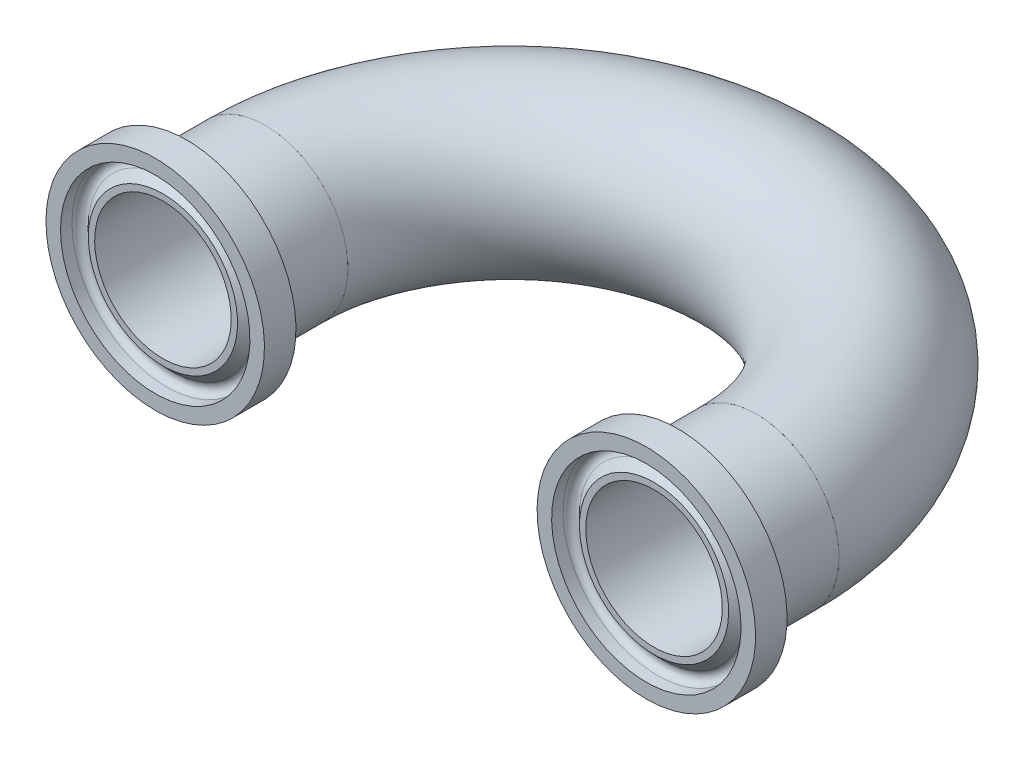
ISO-10303-21;
HEADER;
FILE_DESCRIPTION(('STEP AP214'),'2;1');
FILE_NAME('part.step','',(''),(''),'','','');
FILE_SCHEMA(('AUTOMOTIVE_DESIGN { 1 0 10303 214 1 1 1 1 }'));
ENDSEC;
DATA;
#1=APPLICATION_CONTEXT('core data for automotive mechanical design processes');
#2=APPLICATION_PROTOCOL_DEFINITION('international standard','automotive_design',2000,#1);
#3=PRODUCT_CONTEXT('',#1,'mechanical');
#4=PRODUCT('Part','Part','',(#3));
#5=PRODUCT_RELATED_PRODUCT_CATEGORY('part','',(#4));
#6=PRODUCT_DEFINITION_FORMATION('','',#4);
#7=PRODUCT_DEFINITION_CONTEXT('part definition',#1,'design');
#8=PRODUCT_DEFINITION('design','',#6,#7);
#9=PRODUCT_DEFINITION_SHAPE('','',#8);
#10=(LENGTH_UNIT() NAMED_UNIT(*) SI_UNIT(.MILLI.,.METRE.));
#11=(NAMED_UNIT(*) PLANE_ANGLE_UNIT() SI_UNIT($,.RADIAN.));
#12=(NAMED_UNIT(*) SI_UNIT($,.STERADIAN.) SOLID_ANGLE_UNIT());
#13=UNCERTAINTY_MEASURE_WITH_UNIT(LENGTH_MEASURE(1.E-05),#10,'distance_accuracy_value','');
#14=(GEOMETRIC_REPRESENTATION_CONTEXT(3) GLOBAL_UNCERTAINTY_ASSIGNED_CONTEXT((#13)) GLOBAL_UNIT_ASSIGNED_CONTEXT((#10,
#11,#12)) REPRESENTATION_CONTEXT('',''));
#15=CARTESIAN_POINT('',(0.,0.,0.));
#16=DIRECTION('',(0.,0.,1.));
#17=DIRECTION('',(1.,0.,0.));
#18=AXIS2_PLACEMENT_3D('',#15,#16,#17);
#19=CARTESIAN_POINT('',(-6.19954478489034,34.9272940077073,49.3880198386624));
#20=DIRECTION('',(0.,0.,-1.));
#21=DIRECTION('',(-1.,0.,0.));
#22=AXIS2_PLACEMENT_3D('',#19,#20,#21);
#23=CIRCLE('',#22,9.525);
#24=CARTESIAN_POINT('',(22.3743104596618,34.9272940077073,49.643796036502));
#25=DIRECTION('',(0.,-1.,0.));
#26=AXIS1_PLACEMENT('',#24,#25);
#27=SURFACE_OF_REVOLUTION('',#23,#26);
#28=CARTESIAN_POINT('',(-15.7245447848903,34.9272940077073,49.388019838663));
#29=VERTEX_POINT('',#28);
#30=EDGE_CURVE('P0_E10',#29,#29,#23,.T.);
#31=ORIENTED_EDGE('',*,*,#30,.T.);
#32=EDGE_LOOP('',(#31));
#33=FACE_BOUND('',#32,.T.);
#34=CARTESIAN_POINT('',(50.9481657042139,34.9272940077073,49.8995722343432));
#35=DIRECTION('',(0.,0.,1.));
#36=DIRECTION('',(1.,0.,0.));
#37=AXIS2_PLACEMENT_3D('',#34,#35,#36);
#38=CIRCLE('',#37,9.525);
#39=CARTESIAN_POINT('',(60.4731657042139,34.9272940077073,49.8995722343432));
#40=VERTEX_POINT('',#39);
#41=EDGE_CURVE('P0_E22',#40,#40,#38,.T.);
#42=ORIENTED_EDGE('',*,*,#41,.F.);
#43=EDGE_LOOP('',(#42));
#44=FACE_BOUND('',#43,.T.);
#45=ADVANCED_FACE('P0_F15',(#33,#44),#27,.F.);
#46=CARTESIAN_POINT('',(-6.19954478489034,34.9272940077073,49.3880198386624));
#47=DIRECTION('',(0.,0.,-1.));
#48=DIRECTION('',(-1.,0.,0.));
#49=AXIS2_PLACEMENT_3D('',#46,#47,#48);
#50=PLANE('',#49);
#51=CARTESIAN_POINT('',(1.67431825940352,34.9272940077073,49.3880198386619));
#52=CARTESIAN_POINT('',(1.67431984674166,34.7060670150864,49.3880198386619));
#53=CARTESIAN_POINT('',(1.66499138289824,34.4848660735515,49.3880198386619));
#54=CARTESIAN_POINT('',(1.62774261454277,34.0439625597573,49.3880198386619));
#55=CARTESIAN_POINT('',(1.5998174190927,33.8242603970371,49.3880198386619));
#56=CARTESIAN_POINT('',(1.52553355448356,33.3877967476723,49.3880198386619));
#57=CARTESIAN_POINT('',(1.47915847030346,33.1710380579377,49.388019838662));
#58=CARTESIAN_POINT('',(1.36828516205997,32.7421207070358,49.388019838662));
#59=CARTESIAN_POINT('',(1.30378031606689,32.529963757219,49.388019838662));
#60=CARTESIAN_POINT('',(1.15716259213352,32.1119834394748,49.388019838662));
#61=CARTESIAN_POINT('',(1.0750614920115,31.9061559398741,49.388019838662));
#62=CARTESIAN_POINT('',(0.893808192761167,31.5021468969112,49.388019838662));
#63=CARTESIAN_POINT('',(0.794655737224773,31.3039654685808,49.388019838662));
#64=CARTESIAN_POINT('',(0.580034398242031,30.916713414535,49.388019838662));
#65=CARTESIAN_POINT('',(0.464569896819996,30.7276403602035,49.388019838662));
#66=CARTESIAN_POINT('',(0.218122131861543,30.3598878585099,49.388019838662));
#67=CARTESIAN_POINT('',(0.0871385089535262,30.1812086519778,49.388019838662));
#68=CARTESIAN_POINT('',(-0.189400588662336,29.8355360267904,49.3880198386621));
#69=CARTESIAN_POINT('',(-0.334954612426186,29.6685414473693,49.3880198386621));
#70=CARTESIAN_POINT('',(-0.63966385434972,29.347349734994,49.3880198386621));
#71=CARTESIAN_POINT('',(-0.798823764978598,29.1931570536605,49.3880198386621));
#72=CARTESIAN_POINT('',(-1.12954601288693,28.8987512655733,49.3880198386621));
#73=CARTESIAN_POINT('',(-1.30110659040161,28.758536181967,49.3880198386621));
#74=CARTESIAN_POINT('',(-1.6554331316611,28.4930556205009,49.3880198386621));
#75=CARTESIAN_POINT('',(-1.83819926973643,28.3677903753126,49.3880198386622));
#76=CARTESIAN_POINT('',(-2.21362354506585,28.1331098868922,49.3880198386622));
#77=CARTESIAN_POINT('',(-2.4062810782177,28.0236936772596,49.3880198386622));
#78=CARTESIAN_POINT('',(-2.80013311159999,27.8214777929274,49.3880198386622));
#79=CARTESIAN_POINT('',(-3.00132780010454,27.7286784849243,49.3880198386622));
#80=CARTESIAN_POINT('',(-3.41078153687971,27.5603748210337,49.3880198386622));
#81=CARTESIAN_POINT('',(-3.61903926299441,27.4848672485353,49.3880198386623));
#82=CARTESIAN_POINT('',(-4.0412476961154,27.3516384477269,49.3880198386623));
#83=CARTESIAN_POINT('',(-4.25520034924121,27.2939233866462,49.3880198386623));
#84=CARTESIAN_POINT('',(-4.68716813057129,27.1967343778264,49.3880198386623));
#85=CARTESIAN_POINT('',(-4.90518250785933,27.1572570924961,49.3880198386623));
#86=CARTESIAN_POINT('',(-5.34376535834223,27.0968081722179,49.3880198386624));
#87=CARTESIAN_POINT('',(-5.56433387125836,27.0758368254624,49.3880198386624));
#88=CARTESIAN_POINT('',(-6.00644894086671,27.052550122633,49.3880198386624));
#89=CARTESIAN_POINT('',(-6.22799547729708,27.0502343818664,49.3880198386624));
#90=CARTESIAN_POINT('',(-6.6705010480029,27.0642744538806,49.3880198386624));
#91=CARTESIAN_POINT('',(-6.89146006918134,27.0806306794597,49.3880198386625));
#92=CARTESIAN_POINT('',(-7.33117608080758,27.1318945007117,49.3880198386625));
#93=CARTESIAN_POINT('',(-7.54993345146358,27.1667988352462,49.3880198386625));
#94=CARTESIAN_POINT('',(-7.98380616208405,27.2549240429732,49.3880198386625));
#95=CARTESIAN_POINT('',(-8.19892021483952,27.3081512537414,49.3880198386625));
#96=CARTESIAN_POINT('',(-8.62386043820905,27.4325298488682,49.3880198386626));
#97=CARTESIAN_POINT('',(-8.83368755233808,27.5036780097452,49.3880198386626));
#98=CARTESIAN_POINT('',(-9.24660560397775,27.663398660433,49.3880198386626));
#99=CARTESIAN_POINT('',(-9.44969643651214,27.7519714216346,49.3880198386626));
#100=CARTESIAN_POINT('',(-9.84769272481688,27.9459099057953,49.3880198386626));
#101=CARTESIAN_POINT('',(-10.042598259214,28.0512754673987,49.3880198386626));
#102=CARTESIAN_POINT('',(-10.4228446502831,28.2780536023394,49.3880198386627));
#103=CARTESIAN_POINT('',(-10.6081852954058,28.3994665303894,49.3880198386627));
#104=CARTESIAN_POINT('',(-10.9679463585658,28.65745053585,49.3880198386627));
#105=CARTESIAN_POINT('',(-11.1423687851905,28.7940188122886,49.3880198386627));
#106=CARTESIAN_POINT('',(-11.4791494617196,29.0814109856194,49.3880198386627));
#107=CARTESIAN_POINT('',(-11.6415035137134,29.232239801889,49.3880198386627));
#108=CARTESIAN_POINT('',(-11.9528989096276,29.547012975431,49.3880198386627));
#109=CARTESIAN_POINT('',(-12.1019425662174,29.7109550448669,49.3880198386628));
#110=CARTESIAN_POINT('',(-12.3856915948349,30.0508147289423,49.3880198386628));
#111=CARTESIAN_POINT('',(-12.5203967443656,30.226732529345,49.3880198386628));
#112=CARTESIAN_POINT('',(-12.7745060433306,30.5892873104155,49.3880198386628));
#113=CARTESIAN_POINT('',(-12.893910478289,30.7759240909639,49.3880198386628));
#114=CARTESIAN_POINT('',(-13.1165749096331,31.1585972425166,49.3880198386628));
#115=CARTESIAN_POINT('',(-13.2198345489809,31.3546338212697,49.3880198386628));
#116=CARTESIAN_POINT('',(-13.4094546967,31.7546722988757,49.3880198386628));
#117=CARTESIAN_POINT('',(-13.4958182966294,31.95867273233,49.3880198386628));
#118=CARTESIAN_POINT('',(-13.6510834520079,32.3732957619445,49.3880198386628));
#119=CARTESIAN_POINT('',(-13.7199788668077,32.5839206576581,49.3880198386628));
#120=CARTESIAN_POINT('',(-13.8397539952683,33.0101405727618,49.3880198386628));
#121=CARTESIAN_POINT('',(-13.8906409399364,33.2257335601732,49.3880198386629));
#122=CARTESIAN_POINT('',(-13.9740950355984,33.6605379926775,49.3880198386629));
#123=CARTESIAN_POINT('',(-14.0066538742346,33.8797510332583,49.3880198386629));
#124=CARTESIAN_POINT('',(-14.0531846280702,34.3201412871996,49.3880198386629));
#125=CARTESIAN_POINT('',(-14.0671565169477,34.5413185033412,49.3880198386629));
#126=CARTESIAN_POINT('',(-14.0764118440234,34.9839632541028,49.3880198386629));
#127=CARTESIAN_POINT('',(-14.0717037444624,35.2054306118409,49.3880198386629));
#128=CARTESIAN_POINT('',(-14.0436459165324,35.6472708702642,49.3880198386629));
#129=CARTESIAN_POINT('',(-14.0202886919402,35.8676432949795,49.3880198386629));
#130=CARTESIAN_POINT('',(-13.9551008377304,36.3055595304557,49.3880198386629));
#131=CARTESIAN_POINT('',(-13.9132766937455,36.5231043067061,49.3880198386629));
#132=CARTESIAN_POINT('',(-13.8114442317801,36.9539384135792,49.3880198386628));
#133=CARTESIAN_POINT('',(-13.7514325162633,37.1672269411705,49.3880198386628));
#134=CARTESIAN_POINT('',(-13.613655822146,37.587985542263,49.3880198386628));
#135=CARTESIAN_POINT('',(-13.5358912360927,37.7954557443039,49.3880198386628));
#136=CARTESIAN_POINT('',(-13.3631592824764,38.203111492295,49.3880198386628));
#137=CARTESIAN_POINT('',(-13.2681915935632,38.403296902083,49.3880198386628));
#138=CARTESIAN_POINT('',(-13.0617311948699,38.7949526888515,49.3880198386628));
#139=CARTESIAN_POINT('',(-12.9502387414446,38.9864232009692,49.3880198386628));
#140=CARTESIAN_POINT('',(-12.7114987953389,39.359324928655,49.3880198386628));
#141=CARTESIAN_POINT('',(-12.5842484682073,39.5407543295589,49.3880198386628));
#142=CARTESIAN_POINT('',(-12.3149603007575,39.8921853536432,49.3880198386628));
#143=CARTESIAN_POINT('',(-12.1729275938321,40.0621909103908,49.3880198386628));
#144=CARTESIAN_POINT('',(-11.8750201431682,40.3896650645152,49.3880198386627));
#145=CARTESIAN_POINT('',(-11.7191428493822,40.5471313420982,49.3880198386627));
#146=CARTESIAN_POINT('',(-11.3946804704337,40.8483691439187,49.3880198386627));
#147=CARTESIAN_POINT('',(-11.2260956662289,40.9921409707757,49.3880198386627));
#148=CARTESIAN_POINT('',(-10.8774107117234,41.2649740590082,49.3880198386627));
#149=CARTESIAN_POINT('',(-10.6973103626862,41.3940350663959,49.3880198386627));
#150=CARTESIAN_POINT('',(-10.3268802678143,41.6365241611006,49.3880198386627));
#151=CARTESIAN_POINT('',(-10.1365506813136,41.7499524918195,49.3880198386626));
#152=CARTESIAN_POINT('',(-9.74697754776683,41.960391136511,49.3880198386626));
#153=CARTESIAN_POINT('',(-9.54773240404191,42.057398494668,49.3880198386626));
#154=CARTESIAN_POINT('',(-9.14184739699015,42.2342497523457,49.3880198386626));
#155=CARTESIAN_POINT('',(-8.93521011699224,42.3140995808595,49.3880198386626));
#156=CARTESIAN_POINT('',(-8.51590652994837,42.4561235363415,49.3880198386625));
#157=CARTESIAN_POINT('',(-8.30323914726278,42.5182944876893,49.3880198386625));
#158=CARTESIAN_POINT('',(-7.87342764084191,42.6244983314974,49.3880198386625));
#159=CARTESIAN_POINT('',(-7.65628361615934,42.6685316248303,49.3880198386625));
#160=CARTESIAN_POINT('',(-7.21905346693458,42.7381497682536,49.3880198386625));
#161=CARTESIAN_POINT('',(-6.99896728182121,42.7637342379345,49.3880198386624));
#162=CARTESIAN_POINT('',(-6.55742540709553,42.7962710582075,49.3880198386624));
#163=CARTESIAN_POINT('',(-6.33596973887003,42.8032236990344,49.3880198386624));
#164=CARTESIAN_POINT('',(-5.89322191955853,42.7984477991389,49.3880198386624));
#165=CARTESIAN_POINT('',(-5.67192980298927,42.7867160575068,49.3880198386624));
#166=CARTESIAN_POINT('',(-5.23119735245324,42.7446560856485,49.3880198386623));
#167=CARTESIAN_POINT('',(-5.01175640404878,42.714334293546,49.3880198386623));
#168=CARTESIAN_POINT('',(-4.57616765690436,42.6353079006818,49.3880198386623));
#169=CARTESIAN_POINT('',(-4.36002047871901,42.5865998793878,49.3880198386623));
#170=CARTESIAN_POINT('',(-3.93260261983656,42.4711490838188,49.3880198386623));
#171=CARTESIAN_POINT('',(-3.72133183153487,42.4044067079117,49.3880198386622));
#172=CARTESIAN_POINT('',(-3.30515806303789,42.2533590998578,49.3880198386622));
#173=CARTESIAN_POINT('',(-3.1002552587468,42.1690533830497,49.3880198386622));
#174=CARTESIAN_POINT('',(-2.69828355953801,41.9834810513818,49.3880198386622));
#175=CARTESIAN_POINT('',(-2.50121454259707,41.882214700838,49.3880198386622));
#176=CARTESIAN_POINT('',(-2.11628084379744,41.6634246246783,49.3880198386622));
#177=CARTESIAN_POINT('',(-1.92841746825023,41.545898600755,49.3880198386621));
#178=CARTESIAN_POINT('',(-1.56332423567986,41.295479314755,49.3880198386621));
#179=CARTESIAN_POINT('',(-1.38609072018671,41.1625913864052,49.3880198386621));
#180=CARTESIAN_POINT('',(-1.04343338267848,40.8823495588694,49.3880198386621));
#181=CARTESIAN_POINT('',(-0.878010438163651,40.7349945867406,49.3880198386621));
#182=CARTESIAN_POINT('',(-0.560168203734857,40.4268779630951,49.3880198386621));
#183=CARTESIAN_POINT('',(-0.407748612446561,40.2661166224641,49.3880198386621));
#184=CARTESIAN_POINT('',(-0.116952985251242,39.9322821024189,49.388019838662));
#185=CARTESIAN_POINT('',(0.0214192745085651,39.7592056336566,49.388019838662));
#186=CARTESIAN_POINT('',(0.283087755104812,39.4020127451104,49.388019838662));
#187=CARTESIAN_POINT('',(0.406384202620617,39.2178964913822,49.388019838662));
#188=CARTESIAN_POINT('',(0.637105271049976,38.8398021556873,49.388019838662));
#189=CARTESIAN_POINT('',(0.74451906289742,38.6458174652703,49.388019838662));
#190=CARTESIAN_POINT('',(0.942573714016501,38.2495565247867,49.388019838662));
#191=CARTESIAN_POINT('',(1.03322069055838,38.0472833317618,49.388019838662));
#192=CARTESIAN_POINT('',(1.19707285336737,37.6359968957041,49.388019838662));
#193=CARTESIAN_POINT('',(1.27029350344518,37.4269898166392,49.388019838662));
#194=CARTESIAN_POINT('',(1.39885834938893,37.0036223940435,49.388019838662));
#195=CARTESIAN_POINT('',(1.45420724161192,36.7892634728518,49.3880198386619));
#196=CARTESIAN_POINT('',(1.55817639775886,36.3027475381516,49.3880198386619));
#197=CARTESIAN_POINT('',(1.60169264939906,36.0294848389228,49.3880198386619));
#198=CARTESIAN_POINT('',(1.65976258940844,35.4798992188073,49.3880198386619));
#199=CARTESIAN_POINT('',(1.67431627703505,35.2035762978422,49.3880198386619));
#200=CARTESIAN_POINT('',(1.67431825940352,34.9272940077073,49.3880198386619));
#201=B_SPLINE_CURVE_WITH_KNOTS('',3,(#51,#52,#53,#54,#55,#56,#57,#58,#59,#60,#61,#62,#63,#64,
#65,#66,#67,#68,#69,#70,#71,#72,#73,#74,#75,#76,#77,#78,#79,#80,#81,#82,#83,#84,#85,#86,#87,#88,
#89,#90,#91,#92,#93,#94,#95,#96,#97,#98,#99,#100,#101,#102,#103,#104,#105,#106,#107,#108,#109,
#110,#111,#112,#113,#114,#115,#116,#117,#118,#119,#120,#121,#122,#123,#124,#125,#126,#127,#128,
#129,#130,#131,#132,#133,#134,#135,#136,#137,#138,#139,#140,#141,#142,#143,#144,#145,#146,#147,
#148,#149,#150,#151,#152,#153,#154,#155,#156,#157,#158,#159,#160,#161,#162,#163,#164,#165,#166,
#167,#168,#169,#170,#171,#172,#173,#174,#175,#176,#177,#178,#179,#180,#181,#182,#183,#184,#185,
#186,#187,#188,#189,#190,#191,#192,#193,#194,#195,#196,#197,#198,#199,#200),.UNSPECIFIED.,.T.,
.F.,(4,2,2,2,2,2,2,2,2,2,2,2,2,2,2,2,2,2,2,2,2,2,2,2,2,2,2,2,2,2,2,2,2,2,2,2,2,2,2,2,2,2,2,2,2,
2,2,2,2,2,2,2,2,2,2,2,2,2,2,2,2,2,2,2,2,2,2,2,2,2,2,2,2,2,4),(0.,0.663439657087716,
1.32705386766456,1.99125982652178,2.65570870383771,3.31971422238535,3.98372972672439,
4.64756718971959,5.31142002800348,5.97520682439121,6.63922348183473,7.30314609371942,
7.96707903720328,8.6309714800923,9.29487857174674,9.95866206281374,10.6226753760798,
11.2865671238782,11.9504692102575,12.6143576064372,13.2782606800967,13.942047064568,
14.606063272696,15.2699601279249,15.9338673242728,16.5977681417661,17.2616836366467,
17.9254766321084,18.5894994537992,19.2534066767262,19.9173242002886,20.5812293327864,
21.2451491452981,21.9089473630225,22.5729786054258,23.2367429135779,23.9008080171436,
24.5648740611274,25.2286393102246,25.8926715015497,26.5564706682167,27.2203939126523,
27.8843024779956,28.5482234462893,29.2121341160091,29.8761643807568,30.5399648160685,
31.2038877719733,31.8677960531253,32.5317157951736,33.1956251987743,33.8596539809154,
34.523452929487,35.1873710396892,35.8512744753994,36.5151916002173,37.1790983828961,
37.8431189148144,38.5069096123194,39.1708238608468,39.8347234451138,40.4986413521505,
41.1625489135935,41.8265504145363,42.4903220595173,43.1541429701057,43.8179484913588,
44.4819319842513,45.145905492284,45.8103296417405,46.4745108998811,47.1381005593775,
47.8015156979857,48.6300611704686,49.4586066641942),.UNSPECIFIED.);
#202=CARTESIAN_POINT('',(1.67431825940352,34.9272940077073,49.3880198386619));
#203=VERTEX_POINT('',#202);
#204=EDGE_CURVE('P0_E26',#203,#203,#201,.T.);
#205=ORIENTED_EDGE('',*,*,#204,.T.);
#206=EDGE_LOOP('',(#205));
#207=FACE_BOUND('',#206,.T.);
#208=ORIENTED_EDGE('',*,*,#30,.F.);
#209=EDGE_LOOP('',(#208));
#210=FACE_BOUND('',#209,.T.);
#211=ADVANCED_FACE('P0_F53',(#207,#210),#50,.F.);
#212=CARTESIAN_POINT('',(50.9481657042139,34.9272940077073,49.8995722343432));
#213=DIRECTION('',(0.,0.,1.));
#214=DIRECTION('',(1.,0.,0.));
#215=AXIS2_PLACEMENT_3D('',#212,#213,#214);
#216=PLANE('',#215);
#217=CARTESIAN_POINT('',(43.07430265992,34.9272940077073,49.8995722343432));
#218=CARTESIAN_POINT('',(43.0743010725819,34.7060670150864,49.8995722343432));
#219=CARTESIAN_POINT('',(43.0836295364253,34.4848660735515,49.8995722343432));
#220=CARTESIAN_POINT('',(43.1208783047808,34.0439625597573,49.8995722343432));
#221=CARTESIAN_POINT('',(43.1488035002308,33.8242603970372,49.8995722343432));
#222=CARTESIAN_POINT('',(43.22308736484,33.3877967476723,49.8995722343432));
#223=CARTESIAN_POINT('',(43.2694624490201,33.1710380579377,49.8995722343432));
#224=CARTESIAN_POINT('',(43.3803357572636,32.7421207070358,49.8995722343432));
#225=CARTESIAN_POINT('',(43.4448406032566,32.529963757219,49.8995722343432));
#226=CARTESIAN_POINT('',(43.59145832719,32.1119834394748,49.8995722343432));
#227=CARTESIAN_POINT('',(43.673559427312,31.9061559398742,49.8995722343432));
#228=CARTESIAN_POINT('',(43.8548127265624,31.5021468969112,49.8995722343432));
#229=CARTESIAN_POINT('',(43.9539651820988,31.3039654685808,49.8995722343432));
#230=CARTESIAN_POINT('',(44.1685865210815,30.916713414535,49.8995722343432));
#231=CARTESIAN_POINT('',(44.2840510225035,30.7276403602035,49.8995722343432));
#232=CARTESIAN_POINT('',(44.530498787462,30.3598878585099,49.8995722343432));
#233=CARTESIAN_POINT('',(44.66148241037,30.1812086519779,49.8995722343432));
#234=CARTESIAN_POINT('',(44.9380215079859,29.8355360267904,49.8995722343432));
#235=CARTESIAN_POINT('',(45.0835755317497,29.6685414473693,49.8995722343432));
#236=CARTESIAN_POINT('',(45.3882847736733,29.347349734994,49.8995722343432));
#237=CARTESIAN_POINT('',(45.5474446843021,29.1931570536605,49.8995722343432));
#238=CARTESIAN_POINT('',(45.8781669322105,28.8987512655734,49.8995722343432));
#239=CARTESIAN_POINT('',(46.0497275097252,28.758536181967,49.8995722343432));
#240=CARTESIAN_POINT('',(46.4040540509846,28.4930556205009,49.8995722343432));
#241=CARTESIAN_POINT('',(46.58682018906,28.3677903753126,49.8995722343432));
#242=CARTESIAN_POINT('',(46.9622444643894,28.1331098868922,49.8995722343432));
#243=CARTESIAN_POINT('',(47.1549019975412,28.0236936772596,49.8995722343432));
#244=CARTESIAN_POINT('',(47.5487540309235,27.8214777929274,49.8995722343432));
#245=CARTESIAN_POINT('',(47.7499487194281,27.7286784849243,49.8995722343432));
#246=CARTESIAN_POINT('',(48.1594024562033,27.5603748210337,49.8995722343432));
#247=CARTESIAN_POINT('',(48.367660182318,27.4848672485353,49.8995722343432));
#248=CARTESIAN_POINT('',(48.7898686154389,27.3516384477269,49.8995722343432));
#249=CARTESIAN_POINT('',(49.0038212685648,27.2939233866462,49.8995722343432));
#250=CARTESIAN_POINT('',(49.4357890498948,27.1967343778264,49.8995722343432));
#251=CARTESIAN_POINT('',(49.6538034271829,27.1572570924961,49.8995722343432));
#252=CARTESIAN_POINT('',(50.0923862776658,27.0968081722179,49.8995722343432));
#253=CARTESIAN_POINT('',(50.3129547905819,27.0758368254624,49.8995722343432));
#254=CARTESIAN_POINT('',(50.7550698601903,27.052550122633,49.8995722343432));
#255=CARTESIAN_POINT('',(50.9766163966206,27.0502343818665,49.8995722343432));
#256=CARTESIAN_POINT('',(51.4191219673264,27.0642744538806,49.8995722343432));
#257=CARTESIAN_POINT('',(51.6400809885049,27.0806306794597,49.8995722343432));
#258=CARTESIAN_POINT('',(52.0797970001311,27.1318945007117,49.8995722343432));
#259=CARTESIAN_POINT('',(52.2985543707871,27.1667988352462,49.8995722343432));
#260=CARTESIAN_POINT('',(52.7324270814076,27.2549240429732,49.8995722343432));
#261=CARTESIAN_POINT('',(52.9475411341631,27.3081512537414,49.8995722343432));
#262=CARTESIAN_POINT('',(53.3724813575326,27.4325298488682,49.8995722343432));
#263=CARTESIAN_POINT('',(53.5823084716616,27.5036780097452,49.8995722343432));
#264=CARTESIAN_POINT('',(53.9952265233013,27.663398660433,49.8995722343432));
#265=CARTESIAN_POINT('',(54.1983173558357,27.7519714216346,49.8995722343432));
#266=CARTESIAN_POINT('',(54.5963136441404,27.9459099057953,49.8995722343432));
#267=CARTESIAN_POINT('',(54.7912191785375,28.0512754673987,49.8995722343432));
#268=CARTESIAN_POINT('',(55.1714655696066,28.2780536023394,49.8995722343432));
#269=CARTESIAN_POINT('',(55.3568062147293,28.3994665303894,49.8995722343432));
#270=CARTESIAN_POINT('',(55.7165672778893,28.65745053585,49.8995722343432));
#271=CARTESIAN_POINT('',(55.8909897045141,28.7940188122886,49.8995722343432));
#272=CARTESIAN_POINT('',(56.2277703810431,29.0814109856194,49.8995722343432));
#273=CARTESIAN_POINT('',(56.390124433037,29.232239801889,49.8995722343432));
#274=CARTESIAN_POINT('',(56.7015198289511,29.547012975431,49.8995722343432));
#275=CARTESIAN_POINT('',(56.850563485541,29.7109550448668,49.8995722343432));
#276=CARTESIAN_POINT('',(57.1343125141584,30.0508147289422,49.8995722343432));
#277=CARTESIAN_POINT('',(57.2690176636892,30.226732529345,49.8995722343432));
#278=CARTESIAN_POINT('',(57.5231269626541,30.5892873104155,49.8995722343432));
#279=CARTESIAN_POINT('',(57.6425313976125,30.7759240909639,49.8995722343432));
#280=CARTESIAN_POINT('',(57.8651958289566,31.1585972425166,49.8995722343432));
#281=CARTESIAN_POINT('',(57.9684554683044,31.3546338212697,49.8995722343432));
#282=CARTESIAN_POINT('',(58.1580756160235,31.7546722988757,49.8995722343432));
#283=CARTESIAN_POINT('',(58.2444392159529,31.95867273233,49.8995722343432));
#284=CARTESIAN_POINT('',(58.3997043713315,32.3732957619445,49.8995722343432));
#285=CARTESIAN_POINT('',(58.4685997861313,32.5839206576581,49.8995722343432));
#286=CARTESIAN_POINT('',(58.5883749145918,33.0101405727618,49.8995722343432));
#287=CARTESIAN_POINT('',(58.63926185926,33.2257335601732,49.8995722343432));
#288=CARTESIAN_POINT('',(58.722715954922,33.6605379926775,49.8995722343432));
#289=CARTESIAN_POINT('',(58.7552747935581,33.8797510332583,49.8995722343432));
#290=CARTESIAN_POINT('',(58.8018055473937,34.3201412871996,49.8995722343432));
#291=CARTESIAN_POINT('',(58.8157774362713,34.5413185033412,49.8995722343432));
#292=CARTESIAN_POINT('',(58.825032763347,34.9839632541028,49.8995722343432));
#293=CARTESIAN_POINT('',(58.8203246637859,35.2054306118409,49.8995722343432));
#294=CARTESIAN_POINT('',(58.792266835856,35.6472708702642,49.8995722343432));
#295=CARTESIAN_POINT('',(58.7689096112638,35.8676432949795,49.8995722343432));
#296=CARTESIAN_POINT('',(58.7037217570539,36.3055595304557,49.8995722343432));
#297=CARTESIAN_POINT('',(58.661897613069,36.5231043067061,49.8995722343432));
#298=CARTESIAN_POINT('',(58.5600651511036,36.9539384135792,49.8995722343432));
#299=CARTESIAN_POINT('',(58.5000534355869,37.1672269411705,49.8995722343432));
#300=CARTESIAN_POINT('',(58.3622767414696,37.587985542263,49.8995722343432));
#301=CARTESIAN_POINT('',(58.2845121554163,37.7954557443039,49.8995722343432));
#302=CARTESIAN_POINT('',(58.1117802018,38.203111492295,49.8995722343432));
#303=CARTESIAN_POINT('',(58.0168125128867,38.403296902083,49.8995722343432));
#304=CARTESIAN_POINT('',(57.8103521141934,38.7949526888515,49.8995722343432));
#305=CARTESIAN_POINT('',(57.6988596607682,38.9864232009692,49.8995722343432));
#306=CARTESIAN_POINT('',(57.4601197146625,39.359324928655,49.8995722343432));
#307=CARTESIAN_POINT('',(57.3328693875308,39.5407543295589,49.8995722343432));
#308=CARTESIAN_POINT('',(57.063581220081,39.8921853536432,49.8995722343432));
#309=CARTESIAN_POINT('',(56.9215485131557,40.0621909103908,49.8995722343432));
#310=CARTESIAN_POINT('',(56.6236410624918,40.3896650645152,49.8995722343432));
#311=CARTESIAN_POINT('',(56.4677637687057,40.5471313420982,49.8995722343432));
#312=CARTESIAN_POINT('',(56.1433013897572,40.8483691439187,49.8995722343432));
#313=CARTESIAN_POINT('',(55.9747165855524,40.9921409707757,49.8995722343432));
#314=CARTESIAN_POINT('',(55.6260316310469,41.2649740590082,49.8995722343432));
#315=CARTESIAN_POINT('',(55.4459312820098,41.3940350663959,49.8995722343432));
#316=CARTESIAN_POINT('',(55.0755011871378,41.6365241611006,49.8995722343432));
#317=CARTESIAN_POINT('',(54.8851716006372,41.7499524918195,49.8995722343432));
#318=CARTESIAN_POINT('',(54.4955984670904,41.960391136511,49.8995722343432));
#319=CARTESIAN_POINT('',(54.2963533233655,42.057398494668,49.8995722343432));
#320=CARTESIAN_POINT('',(53.8904683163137,42.2342497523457,49.8995722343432));
#321=CARTESIAN_POINT('',(53.6838310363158,42.3140995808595,49.8995722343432));
#322=CARTESIAN_POINT('',(53.2645274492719,42.4561235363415,49.8995722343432));
#323=CARTESIAN_POINT('',(53.0518600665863,42.5182944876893,49.8995722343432));
#324=CARTESIAN_POINT('',(52.6220485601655,42.6244983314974,49.8995722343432));
#325=CARTESIAN_POINT('',(52.4049045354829,42.6685316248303,49.8995722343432));
#326=CARTESIAN_POINT('',(51.9676743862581,42.7381497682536,49.8995722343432));
#327=CARTESIAN_POINT('',(51.7475882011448,42.7637342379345,49.8995722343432));
#328=CARTESIAN_POINT('',(51.3060463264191,42.7962710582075,49.8995722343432));
#329=CARTESIAN_POINT('',(51.0845906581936,42.8032236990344,49.8995722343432));
#330=CARTESIAN_POINT('',(50.6418428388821,42.7984477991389,49.8995722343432));
#331=CARTESIAN_POINT('',(50.4205507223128,42.7867160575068,49.8995722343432));
#332=CARTESIAN_POINT('',(49.9798182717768,42.7446560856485,49.8995722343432));
#333=CARTESIAN_POINT('',(49.7603773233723,42.714334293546,49.8995722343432));
#334=CARTESIAN_POINT('',(49.3247885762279,42.6353079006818,49.8995722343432));
#335=CARTESIAN_POINT('',(49.1086413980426,42.5865998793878,49.8995722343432));
#336=CARTESIAN_POINT('',(48.6812235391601,42.4711490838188,49.8995722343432));
#337=CARTESIAN_POINT('',(48.4699527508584,42.4044067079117,49.8995722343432));
#338=CARTESIAN_POINT('',(48.0537789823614,42.2533590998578,49.8995722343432));
#339=CARTESIAN_POINT('',(47.8488761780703,42.1690533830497,49.8995722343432));
#340=CARTESIAN_POINT('',(47.4469044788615,41.9834810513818,49.8995722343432));
#341=CARTESIAN_POINT('',(47.2498354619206,41.882214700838,49.8995722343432));
#342=CARTESIAN_POINT('',(46.864901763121,41.6634246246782,49.8995722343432));
#343=CARTESIAN_POINT('',(46.6770383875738,41.545898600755,49.8995722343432));
#344=CARTESIAN_POINT('',(46.3119451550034,41.295479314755,49.8995722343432));
#345=CARTESIAN_POINT('',(46.1347116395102,41.1625913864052,49.8995722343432));
#346=CARTESIAN_POINT('',(45.792054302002,40.8823495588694,49.8995722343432));
#347=CARTESIAN_POINT('',(45.6266313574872,40.7349945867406,49.8995722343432));
#348=CARTESIAN_POINT('',(45.3087891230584,40.4268779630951,49.8995722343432));
#349=CARTESIAN_POINT('',(45.1563695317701,40.2661166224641,49.8995722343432));
#350=CARTESIAN_POINT('',(44.8655739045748,39.9322821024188,49.8995722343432));
#351=CARTESIAN_POINT('',(44.727201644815,39.7592056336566,49.8995722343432));
#352=CARTESIAN_POINT('',(44.4655331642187,39.4020127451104,49.8995722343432));
#353=CARTESIAN_POINT('',(44.3422367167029,39.2178964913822,49.8995722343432));
#354=CARTESIAN_POINT('',(44.1115156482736,38.8398021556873,49.8995722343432));
#355=CARTESIAN_POINT('',(44.0041018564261,38.6458174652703,49.8995722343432));
#356=CARTESIAN_POINT('',(43.806047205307,38.2495565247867,49.8995722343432));
#357=CARTESIAN_POINT('',(43.7154002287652,38.0472833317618,49.8995722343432));
#358=CARTESIAN_POINT('',(43.5515480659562,37.6359968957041,49.8995722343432));
#359=CARTESIAN_POINT('',(43.4783274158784,37.4269898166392,49.8995722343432));
#360=CARTESIAN_POINT('',(43.3497625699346,37.0036223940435,49.8995722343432));
#361=CARTESIAN_POINT('',(43.2944136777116,36.7892634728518,49.8995722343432));
#362=CARTESIAN_POINT('',(43.1904445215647,36.3027475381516,49.8995722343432));
#363=CARTESIAN_POINT('',(43.1469282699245,36.0294848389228,49.8995722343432));
#364=CARTESIAN_POINT('',(43.0888583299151,35.4798992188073,49.8995722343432));
#365=CARTESIAN_POINT('',(43.0743046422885,35.2035762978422,49.8995722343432));
#366=CARTESIAN_POINT('',(43.07430265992,34.9272940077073,49.8995722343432));
#367=B_SPLINE_CURVE_WITH_KNOTS('',3,(#217,#218,#219,#220,#221,#222,#223,#224,#225,#226,#227,
#228,#229,#230,#231,#232,#233,#234,#235,#236,#237,#238,#239,#240,#241,#242,#243,#244,#245,#246,
#247,#248,#249,#250,#251,#252,#253,#254,#255,#256,#257,#258,#259,#260,#261,#262,#263,#264,#265,
#266,#267,#268,#269,#270,#271,#272,#273,#274,#275,#276,#277,#278,#279,#280,#281,#282,#283,#284,
#285,#286,#287,#288,#289,#290,#291,#292,#293,#294,#295,#296,#297,#298,#299,#300,#301,#302,#303,
#304,#305,#306,#307,#308,#309,#310,#311,#312,#313,#314,#315,#316,#317,#318,#319,#320,#321,#322,
#323,#324,#325,#326,#327,#328,#329,#330,#331,#332,#333,#334,#335,#336,#337,#338,#339,#340,#341,
#342,#343,#344,#345,#346,#347,#348,#349,#350,#351,#352,#353,#354,#355,#356,#357,#358,#359,#360,
#361,#362,#363,#364,#365,#366),.UNSPECIFIED.,.T.,.F.,(4,2,2,2,2,2,2,2,2,2,2,2,2,2,2,2,2,2,2,2,2,
2,2,2,2,2,2,2,2,2,2,2,2,2,2,2,2,2,2,2,2,2,2,2,2,2,2,2,2,2,2,2,2,2,2,2,2,2,2,2,2,2,2,2,2,2,2,2,2,
2,2,2,2,2,4),(0.,0.663439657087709,1.32705386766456,1.99125982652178,2.65570870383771,
3.31971422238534,3.98372972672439,4.64756718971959,5.31142002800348,5.9752068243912,
6.63922348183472,7.30314609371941,7.96707903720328,8.63097148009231,9.29487857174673,
9.95866206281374,10.6226753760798,11.2865671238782,11.9504692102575,12.6143576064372,
13.2782606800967,13.942047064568,14.606063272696,15.2699601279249,15.9338673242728,
16.5977681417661,17.2616836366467,17.9254766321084,18.5894994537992,19.2534066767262,
19.9173242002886,20.5812293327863,21.2451491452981,21.9089473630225,22.5729786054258,
23.2367429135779,23.9008080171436,24.5648740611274,25.2286393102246,25.8926715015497,
26.5564706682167,27.2203939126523,27.8843024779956,28.5482234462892,29.2121341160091,
29.8761643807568,30.5399648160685,31.2038877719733,31.8677960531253,32.5317157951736,
33.1956251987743,33.8596539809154,34.523452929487,35.1873710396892,35.8512744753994,
36.5151916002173,37.1790983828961,37.8431189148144,38.5069096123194,39.1708238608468,
39.8347234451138,40.4986413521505,41.1625489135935,41.8265504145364,42.4903220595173,
43.1541429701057,43.8179484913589,44.4819319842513,45.145905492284,45.8103296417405,
46.4745108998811,47.1381005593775,47.8015156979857,48.6300611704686,49.4586066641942),.UNSPECIFIED.);
#368=CARTESIAN_POINT('',(43.07430265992,34.9272940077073,49.8995722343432));
#369=VERTEX_POINT('',#368);
#370=EDGE_CURVE('P0_E30',#369,#369,#367,.T.);
#371=ORIENTED_EDGE('',*,*,#370,.F.);
#372=EDGE_LOOP('',(#371));
#373=FACE_BOUND('',#372,.T.);
#374=ORIENTED_EDGE('',*,*,#41,.T.);
#375=EDGE_LOOP('',(#374));
#376=FACE_BOUND('',#375,.T.);
#377=ADVANCED_FACE('P0_F48',(#373,#376),#216,.T.);
#378=CARTESIAN_POINT('',(-6.19954478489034,34.9272940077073,49.3880198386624));
#379=DIRECTION('',(0.,0.,-1.));
#380=DIRECTION('',(-1.,0.,0.));
#381=AXIS2_PLACEMENT_3D('',#378,#379,#380);
#382=CIRCLE('',#381,9.525);
#383=CARTESIAN_POINT('',(22.3743104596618,34.9272940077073,49.643796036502));
#384=DIRECTION('',(0.,-1.,0.));
#385=AXIS1_PLACEMENT('',#383,#384);
#386=SURFACE_OF_REVOLUTION('',#382,#385);
#387=OFFSET_SURFACE('',#386,1.651,.F.);
#388=ORIENTED_EDGE('',*,*,#204,.F.);
#389=EDGE_LOOP('',(#388));
#390=FACE_BOUND('',#389,.T.);
#391=ORIENTED_EDGE('',*,*,#370,.T.);
#392=EDGE_LOOP('',(#391));
#393=FACE_BOUND('',#392,.T.);
#394=ADVANCED_FACE('P0_F43',(#390,#393),#387,.T.);
#395=CLOSED_SHELL('',(#45,#211,#377,#394));
#396=MANIFOLD_SOLID_BREP('P0_B1',#395);
#397=CARTESIAN_POINT('',(50.9481657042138,34.9272940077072,62.5995722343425));
#398=DIRECTION('',(0.,0.,1.));
#399=DIRECTION('',(0.864328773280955,-0.502927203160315,0.));
#400=AXIS2_PLACEMENT_3D('',#397,#398,#399);
#401=CYLINDRICAL_SURFACE('',#400,10.922);
#402=CARTESIAN_POINT('',(50.9481657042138,34.9272940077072,61.2787722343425));
#403=DIRECTION('',(0.,0.,1.));
#404=DIRECTION('',(0.864328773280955,-0.502927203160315,0.));
#405=AXIS2_PLACEMENT_3D('',#402,#403,#404);
#406=CIRCLE('',#405,10.922);
#407=CARTESIAN_POINT('',(60.3883645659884,29.4343230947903,61.2787722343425));
#408=VERTEX_POINT('',#407);
#409=EDGE_CURVE('P1_E9',#408,#408,#406,.T.);
#410=ORIENTED_EDGE('',*,*,#409,.F.);
#411=EDGE_LOOP('',(#410));
#412=FACE_BOUND('',#411,.T.);
#413=CARTESIAN_POINT('',(50.9481657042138,34.9272940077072,62.5995722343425));
#414=DIRECTION('',(0.,0.,1.));
#415=DIRECTION('',(0.864328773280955,-0.502927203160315,0.));
#416=AXIS2_PLACEMENT_3D('',#413,#414,#415);
#417=CIRCLE('',#416,10.922);
#418=CARTESIAN_POINT('',(60.3883645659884,29.4343230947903,62.5995722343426));
#419=VERTEX_POINT('',#418);
#420=EDGE_CURVE('P1_E48',#419,#419,#417,.T.);
#421=ORIENTED_EDGE('',*,*,#420,.T.);
#422=EDGE_LOOP('',(#421));
#423=FACE_BOUND('',#422,.T.);
#424=ADVANCED_FACE('P1_F14',(#412,#423),#401,.F.);
#425=CARTESIAN_POINT('',(50.9481657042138,34.9272940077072,61.2787722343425));
#426=DIRECTION('',(0.,0.,1.));
#427=DIRECTION('',(0.864328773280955,-0.502927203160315,0.));
#428=AXIS2_PLACEMENT_3D('',#425,#426,#427);
#429=TOROIDAL_SURFACE('',#428,10.1473,0.7747);
#430=CARTESIAN_POINT('',(50.9481657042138,34.9272940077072,60.7465733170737));
#431=DIRECTION('',(0.,0.,1.));
#432=DIRECTION('',(0.864328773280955,-0.502927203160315,0.));
#433=AXIS2_PLACEMENT_3D('',#430,#431,#432);
#434=CIRCLE('',#433,9.58433960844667);
#435=CARTESIAN_POINT('',(59.2321862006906,30.1070688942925,60.7465733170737));
#436=VERTEX_POINT('',#435);
#437=EDGE_CURVE('P1_E20',#436,#436,#434,.T.);
#438=ORIENTED_EDGE('',*,*,#437,.F.);
#439=EDGE_LOOP('',(#438));
#440=FACE_BOUND('',#439,.T.);
#441=ORIENTED_EDGE('',*,*,#409,.T.);
#442=EDGE_LOOP('',(#441));
#443=FACE_BOUND('',#442,.T.);
#444=ADVANCED_FACE('P1_F97',(#440,#443),#429,.F.);
#445=CARTESIAN_POINT('',(50.9481657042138,34.9272940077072,60.7465733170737));
#446=DIRECTION('',(0.,0.,-1.));
#447=DIRECTION('',(-0.864328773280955,0.502927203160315,0.));
#448=AXIS2_PLACEMENT_3D('',#445,#446,#447);
#449=CONICAL_SURFACE('',#448,9.58433960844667,0.794623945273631);
#450=CARTESIAN_POINT('',(50.9481657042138,34.9272940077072,61.7105722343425));
#451=DIRECTION('',(0.,0.,1.));
#452=DIRECTION('',(0.864328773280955,-0.502927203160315,0.));
#453=AXIS2_PLACEMENT_3D('',#450,#451,#452);
#454=CIRCLE('',#453,8.60238725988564);
#455=CARTESIAN_POINT('',(58.3834565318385,30.600919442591,61.7105722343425));
#456=VERTEX_POINT('',#455);
#457=EDGE_CURVE('P1_E24',#456,#456,#454,.T.);
#458=ORIENTED_EDGE('',*,*,#457,.F.);
#459=EDGE_LOOP('',(#458));
#460=FACE_BOUND('',#459,.T.);
#461=ORIENTED_EDGE('',*,*,#437,.T.);
#462=EDGE_LOOP('',(#461));
#463=FACE_BOUND('',#462,.T.);
#464=ADVANCED_FACE('P1_F92',(#460,#463),#449,.T.);
#465=CARTESIAN_POINT('',(46.6217911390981,27.4920031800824,61.7105722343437));
#466=DIRECTION('',(0.,0.,-1.));
#467=DIRECTION('',(-0.864328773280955,0.502927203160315,0.));
#468=AXIS2_PLACEMENT_3D('',#465,#466,#467);
#469=PLANE('',#468);
#470=CARTESIAN_POINT('',(50.9481657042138,34.9272940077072,61.7105722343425));
#471=DIRECTION('',(0.,0.,1.));
#472=DIRECTION('',(0.864328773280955,-0.502927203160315,0.));
#473=AXIS2_PLACEMENT_3D('',#470,#471,#472);
#474=CIRCLE('',#473,7.874);
#475=CARTESIAN_POINT('',(57.7538904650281,30.9672452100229,61.7105722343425));
#476=VERTEX_POINT('',#475);
#477=EDGE_CURVE('P1_E28',#476,#476,#474,.T.);
#478=ORIENTED_EDGE('',*,*,#477,.F.);
#479=EDGE_LOOP('',(#478));
#480=FACE_BOUND('',#479,.T.);
#481=ORIENTED_EDGE('',*,*,#457,.T.);
#482=EDGE_LOOP('',(#481));
#483=FACE_BOUND('',#482,.T.);
#484=ADVANCED_FACE('P1_F86',(#480,#483),#469,.F.);
#485=CARTESIAN_POINT('',(50.9481657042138,34.9272940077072,62.5995722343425));
#486=DIRECTION('',(0.,0.,1.));
#487=DIRECTION('',(0.864328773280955,-0.502927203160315,0.));
#488=AXIS2_PLACEMENT_3D('',#485,#486,#487);
#489=CYLINDRICAL_SURFACE('',#488,7.874);
#490=CARTESIAN_POINT('',(50.9481657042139,34.9272940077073,49.8995722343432));
#491=DIRECTION('',(0.,0.,1.));
#492=DIRECTION('',(0.864328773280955,-0.502927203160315,0.));
#493=AXIS2_PLACEMENT_3D('',#490,#491,#492);
#494=CIRCLE('',#493,7.874);
#495=CARTESIAN_POINT('',(57.7538904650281,30.967245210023,49.8995722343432));
#496=VERTEX_POINT('',#495);
#497=EDGE_CURVE('P1_E33',#496,#496,#494,.T.);
#498=ORIENTED_EDGE('',*,*,#497,.F.);
#499=EDGE_LOOP('',(#498));
#500=FACE_BOUND('',#499,.T.);
#501=ORIENTED_EDGE('',*,*,#477,.T.);
#502=EDGE_LOOP('',(#501));
#503=FACE_BOUND('',#502,.T.);
#504=ADVANCED_FACE('P1_F80',(#500,#503),#489,.F.);
#505=CARTESIAN_POINT('',(46.9881169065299,28.1215692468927,49.8995722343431));
#506=DIRECTION('',(0.,0.,1.));
#507=DIRECTION('',(0.864328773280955,-0.502927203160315,0.));
#508=AXIS2_PLACEMENT_3D('',#505,#506,#507);
#509=PLANE('',#508);
#510=CARTESIAN_POINT('',(50.9481657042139,34.9272940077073,49.8995722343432));
#511=DIRECTION('',(0.,0.,1.));
#512=DIRECTION('',(0.864328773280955,-0.502927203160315,0.));
#513=AXIS2_PLACEMENT_3D('',#510,#511,#512);
#514=CIRCLE('',#513,9.525);
#515=CARTESIAN_POINT('',(59.180897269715,30.1369123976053,49.8995722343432));
#516=VERTEX_POINT('',#515);
#517=EDGE_CURVE('P1_E36',#516,#516,#514,.T.);
#518=ORIENTED_EDGE('',*,*,#517,.F.);
#519=EDGE_LOOP('',(#518));
#520=FACE_BOUND('',#519,.T.);
#521=ORIENTED_EDGE('',*,*,#497,.T.);
#522=EDGE_LOOP('',(#521));
#523=FACE_BOUND('',#522,.T.);
#524=ADVANCED_FACE('P1_F74',(#520,#523),#509,.F.);
#525=CARTESIAN_POINT('',(50.9481657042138,34.9272940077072,62.5995722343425));
#526=DIRECTION('',(0.,0.,1.));
#527=DIRECTION('',(0.864328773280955,-0.502927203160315,0.));
#528=AXIS2_PLACEMENT_3D('',#525,#526,#527);
#529=CYLINDRICAL_SURFACE('',#528,9.525);
#530=CARTESIAN_POINT('',(50.9481657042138,34.9272940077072,57.8487461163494));
#531=DIRECTION('',(0.,0.,1.));
#532=DIRECTION('',(0.864328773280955,-0.502927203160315,0.));
#533=AXIS2_PLACEMENT_3D('',#530,#531,#532);
#534=CIRCLE('',#533,9.525);
#535=CARTESIAN_POINT('',(59.1808972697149,30.1369123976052,57.8487461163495));
#536=VERTEX_POINT('',#535);
#537=EDGE_CURVE('P1_E39',#536,#536,#534,.T.);
#538=ORIENTED_EDGE('',*,*,#537,.F.);
#539=EDGE_LOOP('',(#538));
#540=FACE_BOUND('',#539,.T.);
#541=ORIENTED_EDGE('',*,*,#517,.T.);
#542=EDGE_LOOP('',(#541));
#543=FACE_BOUND('',#542,.T.);
#544=ADVANCED_FACE('P1_F68',(#540,#543),#529,.T.);
#545=CARTESIAN_POINT('',(50.9481657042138,34.9272940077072,57.8487461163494));
#546=DIRECTION('',(0.,0.,1.));
#547=DIRECTION('',(0.864328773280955,-0.502927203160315,0.));
#548=AXIS2_PLACEMENT_3D('',#545,#546,#547);
#549=CONICAL_SURFACE('',#548,9.525,1.22173047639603);
#550=CARTESIAN_POINT('',(50.9481657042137,34.9272940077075,58.9673722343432));
#551=DIRECTION('',(0.,0.,1.));
#552=DIRECTION('',(0.864328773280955,-0.502927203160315,0.));
#553=AXIS2_PLACEMENT_3D('',#550,#551,#552);
#554=CIRCLE('',#553,12.5984);
#555=CARTESIAN_POINT('',(61.8373253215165,28.5912159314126,58.9673722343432));
#556=VERTEX_POINT('',#555);
#557=EDGE_CURVE('P1_E42',#556,#556,#554,.T.);
#558=ORIENTED_EDGE('',*,*,#557,.F.);
#559=EDGE_LOOP('',(#558));
#560=FACE_BOUND('',#559,.T.);
#561=ORIENTED_EDGE('',*,*,#537,.T.);
#562=EDGE_LOOP('',(#561));
#563=FACE_BOUND('',#562,.T.);
#564=ADVANCED_FACE('P1_F62',(#560,#563),#549,.T.);
#565=CARTESIAN_POINT('',(50.9481657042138,34.9272940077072,62.5995722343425));
#566=DIRECTION('',(0.,0.,1.));
#567=DIRECTION('',(0.864328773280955,-0.502927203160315,0.));
#568=AXIS2_PLACEMENT_3D('',#565,#566,#567);
#569=CYLINDRICAL_SURFACE('',#568,12.5984);
#570=CARTESIAN_POINT('',(50.9481657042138,34.9272940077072,62.5995722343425));
#571=DIRECTION('',(0.,0.,1.));
#572=DIRECTION('',(0.864328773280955,-0.502927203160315,0.));
#573=AXIS2_PLACEMENT_3D('',#570,#571,#572);
#574=CIRCLE('',#573,12.5984);
#575=CARTESIAN_POINT('',(61.8373253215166,28.5912159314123,62.5995722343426));
#576=VERTEX_POINT('',#575);
#577=EDGE_CURVE('P1_E45',#576,#576,#574,.T.);
#578=ORIENTED_EDGE('',*,*,#577,.F.);
#579=EDGE_LOOP('',(#578));
#580=FACE_BOUND('',#579,.T.);
#581=ORIENTED_EDGE('',*,*,#557,.T.);
#582=EDGE_LOOP('',(#581));
#583=FACE_BOUND('',#582,.T.);
#584=ADVANCED_FACE('P1_F56',(#580,#583),#569,.T.);
#585=CARTESIAN_POINT('',(44.6120876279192,24.0381343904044,62.5995722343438));
#586=DIRECTION('',(0.,0.,-1.));
#587=DIRECTION('',(-0.864328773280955,0.502927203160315,0.));
#588=AXIS2_PLACEMENT_3D('',#585,#586,#587);
#589=PLANE('',#588);
#590=ORIENTED_EDGE('',*,*,#420,.F.);
#591=EDGE_LOOP('',(#590));
#592=FACE_BOUND('',#591,.T.);
#593=ORIENTED_EDGE('',*,*,#577,.T.);
#594=EDGE_LOOP('',(#593));
#595=FACE_BOUND('',#594,.T.);
#596=ADVANCED_FACE('P1_F53',(#592,#595),#589,.F.);
#597=CLOSED_SHELL('',(#424,#444,#464,#484,#504,#524,#544,#564,#584,#596));
#598=MANIFOLD_SOLID_BREP('P1_B1',#597);
#599=CARTESIAN_POINT('',(-6.19954478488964,34.9272940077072,62.0880198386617));
#600=DIRECTION('',(0.,0.,1.));
#601=DIRECTION('',(0.913314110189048,-0.407255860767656,0.));
#602=AXIS2_PLACEMENT_3D('',#599,#600,#601);
#603=CYLINDRICAL_SURFACE('',#602,10.922);
#604=CARTESIAN_POINT('',(-6.19954478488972,34.9272940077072,60.7672198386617));
#605=DIRECTION('',(0.,0.,1.));
#606=DIRECTION('',(0.913314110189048,-0.407255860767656,0.));
#607=AXIS2_PLACEMENT_3D('',#604,#605,#606);
#608=CIRCLE('',#607,10.922);
#609=CARTESIAN_POINT('',(3.77567192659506,30.4792454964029,60.7672198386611));
#610=VERTEX_POINT('',#609);
#611=EDGE_CURVE('P2_E10',#610,#610,#608,.T.);
#612=ORIENTED_EDGE('',*,*,#611,.F.);
#613=EDGE_LOOP('',(#612));
#614=FACE_BOUND('',#613,.T.);
#615=CARTESIAN_POINT('',(-6.19954478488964,34.9272940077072,62.0880198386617));
#616=DIRECTION('',(0.,0.,1.));
#617=DIRECTION('',(0.913314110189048,-0.407255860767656,0.));
#618=AXIS2_PLACEMENT_3D('',#615,#616,#617);
#619=CIRCLE('',#618,10.922);
#620=CARTESIAN_POINT('',(3.77567192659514,30.4792454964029,62.0880198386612));
#621=VERTEX_POINT('',#620);
#622=EDGE_CURVE('P2_E49',#621,#621,#619,.T.);
#623=ORIENTED_EDGE('',*,*,#622,.T.);
#624=EDGE_LOOP('',(#623));
#625=FACE_BOUND('',#624,.T.);
#626=ADVANCED_FACE('P2_F15',(#614,#625),#603,.F.);
#627=CARTESIAN_POINT('',(-6.19954478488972,34.9272940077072,60.7672198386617));
#628=DIRECTION('',(0.,0.,1.));
#629=DIRECTION('',(0.913314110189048,-0.407255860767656,0.));
#630=AXIS2_PLACEMENT_3D('',#627,#628,#629);
#631=TOROIDAL_SURFACE('',#630,10.1473,0.7747);
#632=CARTESIAN_POINT('',(-6.19954478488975,34.9272940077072,60.2350209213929));
#633=DIRECTION('',(0.,0.,1.));
#634=DIRECTION('',(0.913314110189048,-0.407255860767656,0.));
#635=AXIS2_PLACEMENT_3D('',#632,#633,#634);
#636=CIRCLE('',#635,9.58433960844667);
#637=CARTESIAN_POINT('',(2.55396781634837,31.0240155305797,60.2350209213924));
#638=VERTEX_POINT('',#637);
#639=EDGE_CURVE('P2_E21',#638,#638,#636,.T.);
#640=ORIENTED_EDGE('',*,*,#639,.F.);
#641=EDGE_LOOP('',(#640));
#642=FACE_BOUND('',#641,.T.);
#643=ORIENTED_EDGE('',*,*,#611,.T.);
#644=EDGE_LOOP('',(#643));
#645=FACE_BOUND('',#644,.T.);
#646=ADVANCED_FACE('P2_F98',(#642,#645),#631,.F.);
#647=CARTESIAN_POINT('',(-6.19954478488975,34.9272940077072,60.2350209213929));
#648=DIRECTION('',(0.,0.,-1.));
#649=DIRECTION('',(-0.913314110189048,0.407255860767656,0.));
#650=AXIS2_PLACEMENT_3D('',#647,#648,#649);
#651=CONICAL_SURFACE('',#650,9.58433960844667,0.794623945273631);
#652=CARTESIAN_POINT('',(-6.19954478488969,34.9272940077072,61.1990198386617));
#653=DIRECTION('',(0.,0.,1.));
#654=DIRECTION('',(0.913314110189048,-0.407255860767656,0.));
#655=AXIS2_PLACEMENT_3D('',#652,#653,#654);
#656=CIRCLE('',#655,8.60238725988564);
#657=CARTESIAN_POINT('',(1.65713688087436,31.4239213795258,61.1990198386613));
#658=VERTEX_POINT('',#657);
#659=EDGE_CURVE('P2_E25',#658,#658,#656,.T.);
#660=ORIENTED_EDGE('',*,*,#659,.F.);
#661=EDGE_LOOP('',(#660));
#662=FACE_BOUND('',#661,.T.);
#663=ORIENTED_EDGE('',*,*,#639,.T.);
#664=EDGE_LOOP('',(#663));
#665=FACE_BOUND('',#664,.T.);
#666=ADVANCED_FACE('P2_F93',(#662,#665),#651,.T.);
#667=CARTESIAN_POINT('',(-9.7029174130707,27.070612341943,61.1990198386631));
#668=DIRECTION('',(0.,0.,-1.));
#669=DIRECTION('',(-0.913314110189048,0.407255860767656,0.));
#670=AXIS2_PLACEMENT_3D('',#667,#668,#669);
#671=PLANE('',#670);
#672=CARTESIAN_POINT('',(-6.19954478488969,34.9272940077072,61.1990198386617));
#673=DIRECTION('',(0.,0.,1.));
#674=DIRECTION('',(0.913314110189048,-0.407255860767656,0.));
#675=AXIS2_PLACEMENT_3D('',#672,#673,#674);
#676=CIRCLE('',#675,7.874);
#677=CARTESIAN_POINT('',(0.991890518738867,31.7205613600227,61.1990198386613));
#678=VERTEX_POINT('',#677);
#679=EDGE_CURVE('P2_E29',#678,#678,#676,.T.);
#680=ORIENTED_EDGE('',*,*,#679,.F.);
#681=EDGE_LOOP('',(#680));
#682=FACE_BOUND('',#681,.T.);
#683=ORIENTED_EDGE('',*,*,#659,.T.);
#684=EDGE_LOOP('',(#683));
#685=FACE_BOUND('',#684,.T.);
#686=ADVANCED_FACE('P2_F87',(#682,#685),#671,.F.);
#687=CARTESIAN_POINT('',(-6.19954478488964,34.9272940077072,62.0880198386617));
#688=DIRECTION('',(0.,0.,1.));
#689=DIRECTION('',(0.913314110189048,-0.407255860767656,0.));
#690=AXIS2_PLACEMENT_3D('',#687,#688,#689);
#691=CYLINDRICAL_SURFACE('',#690,7.874);
#692=CARTESIAN_POINT('',(-6.19954478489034,34.9272940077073,49.3880198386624));
#693=DIRECTION('',(0.,0.,1.));
#694=DIRECTION('',(0.913314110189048,-0.407255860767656,0.));
#695=AXIS2_PLACEMENT_3D('',#692,#693,#694);
#696=CIRCLE('',#695,7.874);
#697=CARTESIAN_POINT('',(0.991890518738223,31.7205613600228,49.388019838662));
#698=VERTEX_POINT('',#697);
#699=EDGE_CURVE('P2_E34',#698,#698,#696,.T.);
#700=ORIENTED_EDGE('',*,*,#699,.F.);
#701=EDGE_LOOP('',(#700));
#702=FACE_BOUND('',#701,.T.);
#703=ORIENTED_EDGE('',*,*,#679,.T.);
#704=EDGE_LOOP('',(#703));
#705=FACE_BOUND('',#704,.T.);
#706=ADVANCED_FACE('P2_F81',(#702,#705),#691,.F.);
#707=CARTESIAN_POINT('',(-9.40627743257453,27.7358587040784,49.3880198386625));
#708=DIRECTION('',(0.,0.,1.));
#709=DIRECTION('',(0.913314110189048,-0.407255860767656,0.));
#710=AXIS2_PLACEMENT_3D('',#707,#708,#709);
#711=PLANE('',#710);
#712=CARTESIAN_POINT('',(-6.19954478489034,34.9272940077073,49.3880198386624));
#713=DIRECTION('',(0.,0.,1.));
#714=DIRECTION('',(0.913314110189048,-0.407255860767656,0.));
#715=AXIS2_PLACEMENT_3D('',#712,#713,#714);
#716=CIRCLE('',#715,9.525);
#717=CARTESIAN_POINT('',(2.49977211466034,31.0481819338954,49.3880198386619));
#718=VERTEX_POINT('',#717);
#719=EDGE_CURVE('P2_E37',#718,#718,#716,.T.);
#720=ORIENTED_EDGE('',*,*,#719,.F.);
#721=EDGE_LOOP('',(#720));
#722=FACE_BOUND('',#721,.T.);
#723=ORIENTED_EDGE('',*,*,#699,.T.);
#724=EDGE_LOOP('',(#723));
#725=FACE_BOUND('',#724,.T.);
#726=ADVANCED_FACE('P2_F75',(#722,#725),#711,.F.);
#727=CARTESIAN_POINT('',(-6.19954478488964,34.9272940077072,62.0880198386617));
#728=DIRECTION('',(0.,0.,1.));
#729=DIRECTION('',(0.913314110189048,-0.407255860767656,0.));
#730=AXIS2_PLACEMENT_3D('',#727,#728,#729);
#731=CYLINDRICAL_SURFACE('',#730,9.525);
#732=CARTESIAN_POINT('',(-6.19954478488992,34.9272940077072,57.3371937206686));
#733=DIRECTION('',(0.,0.,1.));
#734=DIRECTION('',(0.913314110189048,-0.407255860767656,0.));
#735=AXIS2_PLACEMENT_3D('',#732,#733,#734);
#736=CIRCLE('',#735,9.525);
#737=CARTESIAN_POINT('',(2.49977211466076,31.0481819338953,57.3371937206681));
#738=VERTEX_POINT('',#737);
#739=EDGE_CURVE('P2_E40',#738,#738,#736,.T.);
#740=ORIENTED_EDGE('',*,*,#739,.F.);
#741=EDGE_LOOP('',(#740));
#742=FACE_BOUND('',#741,.T.);
#743=ORIENTED_EDGE('',*,*,#719,.T.);
#744=EDGE_LOOP('',(#743));
#745=FACE_BOUND('',#744,.T.);
#746=ADVANCED_FACE('P2_F69',(#742,#745),#731,.T.);
#747=CARTESIAN_POINT('',(-6.19954478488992,34.9272940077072,57.3371937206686));
#748=DIRECTION('',(0.,0.,1.));
#749=DIRECTION('',(0.913314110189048,-0.407255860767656,0.));
#750=AXIS2_PLACEMENT_3D('',#747,#748,#749);
#751=CONICAL_SURFACE('',#750,9.525,1.22173047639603);
#752=CARTESIAN_POINT('',(-6.19954478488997,34.9272940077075,58.4558198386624));
#753=DIRECTION('',(0.,0.,1.));
#754=DIRECTION('',(0.913314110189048,-0.407255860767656,0.));
#755=AXIS2_PLACEMENT_3D('',#752,#753,#754);
#756=CIRCLE('',#755,12.5984);
#757=CARTESIAN_POINT('',(5.30675170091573,29.7965217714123,58.4558198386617));
#758=VERTEX_POINT('',#757);
#759=EDGE_CURVE('P2_E43',#758,#758,#756,.T.);
#760=ORIENTED_EDGE('',*,*,#759,.F.);
#761=EDGE_LOOP('',(#760));
#762=FACE_BOUND('',#761,.T.);
#763=ORIENTED_EDGE('',*,*,#739,.T.);
#764=EDGE_LOOP('',(#763));
#765=FACE_BOUND('',#764,.T.);
#766=ADVANCED_FACE('P2_F63',(#762,#765),#751,.T.);
#767=CARTESIAN_POINT('',(-6.19954478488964,34.9272940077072,62.0880198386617));
#768=DIRECTION('',(0.,0.,1.));
#769=DIRECTION('',(0.913314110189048,-0.407255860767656,0.));
#770=AXIS2_PLACEMENT_3D('',#767,#768,#769);
#771=CYLINDRICAL_SURFACE('',#770,12.5984);
#772=CARTESIAN_POINT('',(-6.19954478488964,34.9272940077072,62.0880198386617));
#773=DIRECTION('',(0.,0.,1.));
#774=DIRECTION('',(0.913314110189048,-0.407255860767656,0.));
#775=AXIS2_PLACEMENT_3D('',#772,#773,#774);
#776=CIRCLE('',#775,12.5984);
#777=CARTESIAN_POINT('',(5.30675170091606,29.796521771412,62.0880198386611));
#778=VERTEX_POINT('',#777);
#779=EDGE_CURVE('P2_E46',#778,#778,#776,.T.);
#780=ORIENTED_EDGE('',*,*,#779,.F.);
#781=EDGE_LOOP('',(#780));
#782=FACE_BOUND('',#781,.T.);
#783=ORIENTED_EDGE('',*,*,#759,.T.);
#784=EDGE_LOOP('',(#783));
#785=FACE_BOUND('',#784,.T.);
#786=ADVANCED_FACE('P2_F57',(#782,#785),#771,.T.);
#787=CARTESIAN_POINT('',(-11.3303170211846,23.4209975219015,62.0880198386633));
#788=DIRECTION('',(0.,0.,-1.));
#789=DIRECTION('',(-0.913314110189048,0.407255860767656,0.));
#790=AXIS2_PLACEMENT_3D('',#787,#788,#789);
#791=PLANE('',#790);
#792=ORIENTED_EDGE('',*,*,#622,.F.);
#793=EDGE_LOOP('',(#792));
#794=FACE_BOUND('',#793,.T.);
#795=ORIENTED_EDGE('',*,*,#779,.T.);
#796=EDGE_LOOP('',(#795));
#797=FACE_BOUND('',#796,.T.);
#798=ADVANCED_FACE('P2_F54',(#794,#797),#791,.F.);
#799=CLOSED_SHELL('',(#626,#646,#666,#686,#706,#726,#746,#766,#786,#798));
#800=MANIFOLD_SOLID_BREP('P2_B1',#799);
#801=ADVANCED_BREP_SHAPE_REPRESENTATION('',(#18,#396,#598,#800),#14);
#802=SHAPE_DEFINITION_REPRESENTATION(#9,#801);
ENDSEC;
END-ISO-10303-21;
